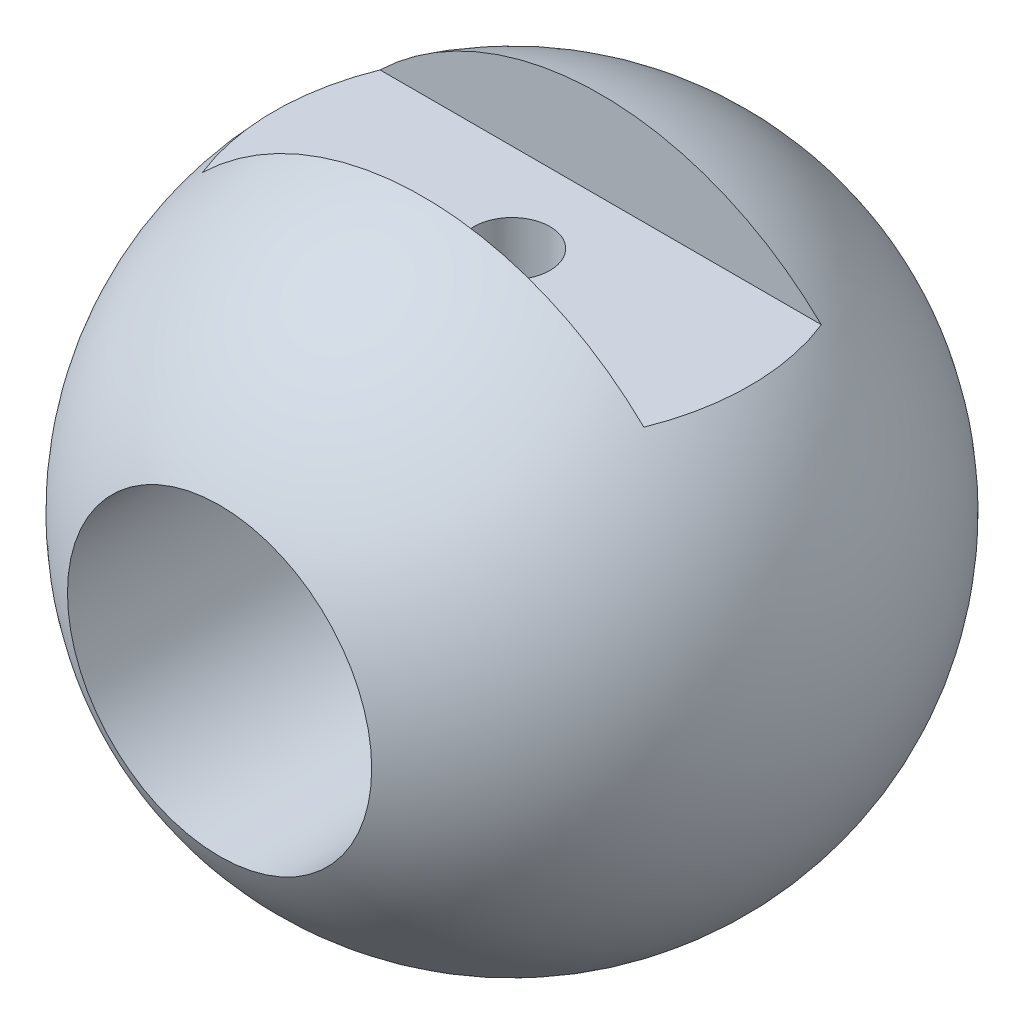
from build123d import *

# Parameters (mm, degrees)
ENL_V_MAT_EXTRU_1_DEPTH      = 40
ENL_V_MAT_EXTRU_1_DEPTH_BACK = 40
ESQUISSE2_R                  = 6
ESQUISSE3_R                  = 1.5
ENL_V_MAT_EXTRU_2_DEPTH      = 20
ESQUISSE6_W                  = 7
ESQUISSE6_H                  = 4
ENL_V_MAT_EXTRU_5_DEPTH      = 15


with BuildPart() as part:
    # Esquisse1 → Base-R_volution (revolve)
    with BuildSketch(Plane.XY):
        with BuildLine():
            Line((-13, 0), (13, 0))
            ThreePointArc((13, 0), (0, 13), (-13, 0))
        make_face()
    revolve(axis=Axis((-29.417217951, 0, 0), (1, 0, 0)))

    # Esquisse2 → Enl_v. mat.-Extru.1 (cut, two sides: drawn at the far end of the back side and taken through both)
    with BuildSketch(Plane.XY.offset(-ENL_V_MAT_EXTRU_1_DEPTH_BACK)):
        Circle(ESQUISSE2_R)
    extrude(amount=ENL_V_MAT_EXTRU_1_DEPTH + ENL_V_MAT_EXTRU_1_DEPTH_BACK, mode=Mode.SUBTRACT)

    # Esquisse3 → Enl_v. mat.-Extru.2 (cut)
    with BuildSketch(Plane(origin=(0, 0, 0), x_dir=(1, 0, 0), z_dir=(0, 1, 0))):
        with Locations(Location((0, 0, 0), (0, 0, 90))):
            Circle(ESQUISSE3_R)
    extrude(amount=ENL_V_MAT_EXTRU_2_DEPTH, mode=Mode.SUBTRACT)

    # Esquisse6 → Enl_v. mat.-Extru.5 (cut, symmetric)
    with BuildSketch(Plane(origin=(0, 0, 0), x_dir=(0, 0, -1), z_dir=(1, 0, 0))):
        with Locations((0, 11)):
            Rectangle(ESQUISSE6_W, ESQUISSE6_H)
    extrude(amount=ENL_V_MAT_EXTRU_5_DEPTH, both=True, mode=Mode.SUBTRACT)


solid = part.part
